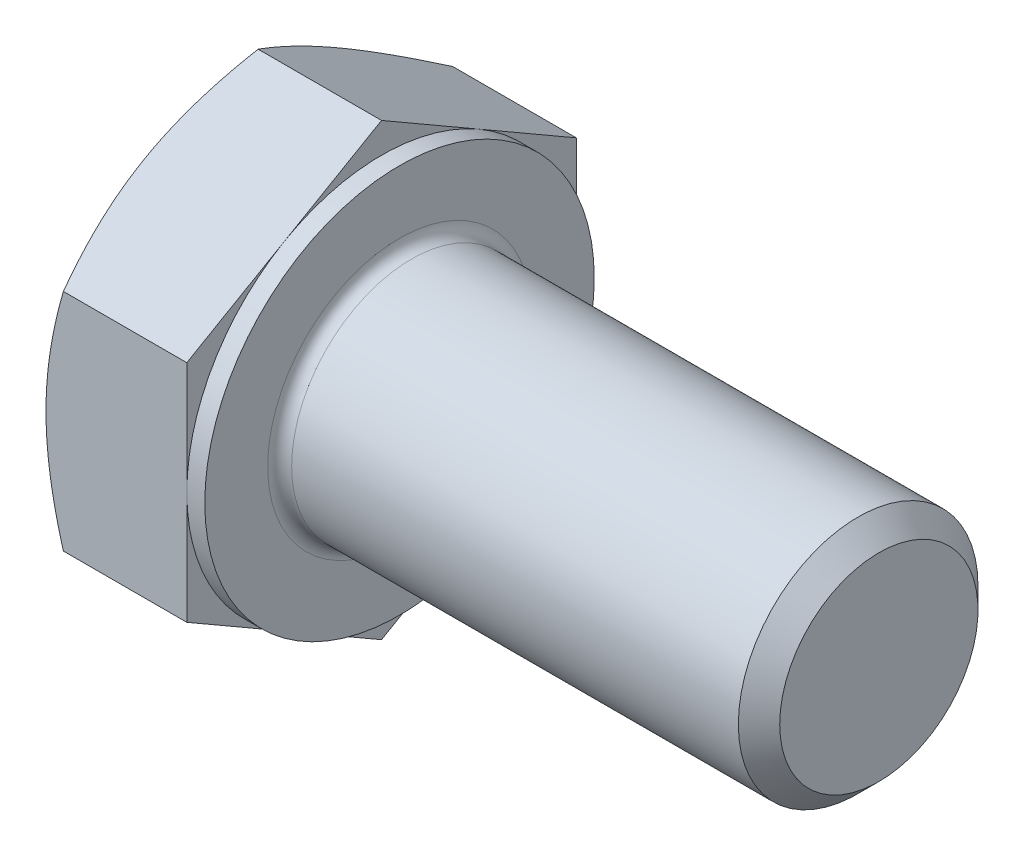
ISO-10303-21;
HEADER;
FILE_DESCRIPTION(('STEP AP214'),'2;1');
FILE_NAME('part.step','',(''),(''),'','','');
FILE_SCHEMA(('AUTOMOTIVE_DESIGN { 1 0 10303 214 1 1 1 1 }'));
ENDSEC;
DATA;
#1=APPLICATION_CONTEXT('core data for automotive mechanical design processes');
#2=APPLICATION_PROTOCOL_DEFINITION('international standard','automotive_design',2000,#1);
#3=PRODUCT_CONTEXT('',#1,'mechanical');
#4=PRODUCT('Part','Part','',(#3));
#5=PRODUCT_RELATED_PRODUCT_CATEGORY('part','',(#4));
#6=PRODUCT_DEFINITION_FORMATION('','',#4);
#7=PRODUCT_DEFINITION_CONTEXT('part definition',#1,'design');
#8=PRODUCT_DEFINITION('design','',#6,#7);
#9=PRODUCT_DEFINITION_SHAPE('','',#8);
#10=(LENGTH_UNIT() NAMED_UNIT(*) SI_UNIT(.MILLI.,.METRE.));
#11=(NAMED_UNIT(*) PLANE_ANGLE_UNIT() SI_UNIT($,.RADIAN.));
#12=(NAMED_UNIT(*) SI_UNIT($,.STERADIAN.) SOLID_ANGLE_UNIT());
#13=UNCERTAINTY_MEASURE_WITH_UNIT(LENGTH_MEASURE(1.E-05),#10,'distance_accuracy_value','');
#14=(GEOMETRIC_REPRESENTATION_CONTEXT(3) GLOBAL_UNCERTAINTY_ASSIGNED_CONTEXT((#13)) GLOBAL_UNIT_ASSIGNED_CONTEXT((#10,
#11,#12)) REPRESENTATION_CONTEXT('',''));
#15=CARTESIAN_POINT('',(0.,0.,0.));
#16=DIRECTION('',(0.,0.,1.));
#17=DIRECTION('',(1.,0.,0.));
#18=AXIS2_PLACEMENT_3D('',#15,#16,#17);
#19=CARTESIAN_POINT('',(5.3,0.,-13.));
#20=DIRECTION('',(1.,0.,0.));
#21=DIRECTION('',(0.,0.,-1.));
#22=AXIS2_PLACEMENT_3D('',#19,#20,#21);
#23=PLANE('',#22);
#24=CARTESIAN_POINT('',(5.3,0.,0.));
#25=DIRECTION('',(1.,0.,0.));
#26=DIRECTION('',(0.,0.,-1.));
#27=AXIS2_PLACEMENT_3D('',#24,#25,#26);
#28=CIRCLE('',#27,4.4);
#29=CARTESIAN_POINT('',(5.3,0.,-4.4));
#30=VERTEX_POINT('',#29);
#31=EDGE_CURVE('E49',#30,#30,#28,.F.);
#32=ORIENTED_EDGE('',*,*,#31,.T.);
#33=EDGE_LOOP('',(#32));
#34=FACE_BOUND('',#33,.T.);
#35=CARTESIAN_POINT('',(5.3,0.,0.));
#36=DIRECTION('',(1.,0.,0.));
#37=DIRECTION('',(0.,0.,-1.));
#38=AXIS2_PLACEMENT_3D('',#35,#36,#37);
#39=CIRCLE('',#38,6.5);
#40=CARTESIAN_POINT('',(5.3,0.,-6.5));
#41=VERTEX_POINT('',#40);
#42=EDGE_CURVE('E308',#41,#41,#39,.T.);
#43=ORIENTED_EDGE('',*,*,#42,.T.);
#44=EDGE_LOOP('',(#43));
#45=FACE_BOUND('',#44,.T.);
#46=ADVANCED_FACE('F41',(#34,#45),#23,.T.);
#47=CARTESIAN_POINT('',(0.,0.,0.));
#48=DIRECTION('',(-1.,0.,0.));
#49=DIRECTION('',(0.,0.,1.));
#50=AXIS2_PLACEMENT_3D('',#47,#48,#49);
#51=CYLINDRICAL_SURFACE('',#50,4.);
#52=CARTESIAN_POINT('',(5.7,0.,0.));
#53=DIRECTION('',(1.,0.,0.));
#54=DIRECTION('',(0.,0.,-1.));
#55=AXIS2_PLACEMENT_3D('',#52,#53,#54);
#56=CIRCLE('',#55,4.);
#57=CARTESIAN_POINT('',(5.7,0.,-4.));
#58=VERTEX_POINT('',#57);
#59=EDGE_CURVE('E11',#58,#58,#56,.T.);
#60=ORIENTED_EDGE('',*,*,#59,.T.);
#61=EDGE_LOOP('',(#60));
#62=FACE_BOUND('',#61,.T.);
#63=CARTESIAN_POINT('',(20.6095,0.,0.));
#64=DIRECTION('',(-1.,0.,0.));
#65=DIRECTION('',(0.,0.,1.));
#66=AXIS2_PLACEMENT_3D('',#63,#64,#65);
#67=CIRCLE('',#66,4.);
#68=CARTESIAN_POINT('',(20.6095,0.,4.));
#69=VERTEX_POINT('',#68);
#70=EDGE_CURVE('E287',#69,#69,#67,.T.);
#71=ORIENTED_EDGE('',*,*,#70,.T.);
#72=EDGE_LOOP('',(#71));
#73=FACE_BOUND('',#72,.T.);
#74=ADVANCED_FACE('F259',(#62,#73),#51,.T.);
#75=CARTESIAN_POINT('',(21.3,0.,0.));
#76=DIRECTION('',(-1.,0.,0.));
#77=DIRECTION('',(0.,0.,1.));
#78=AXIS2_PLACEMENT_3D('',#75,#76,#77);
#79=CONICAL_SURFACE('',#78,3.3095,0.785398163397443);
#80=ORIENTED_EDGE('',*,*,#70,.F.);
#81=EDGE_LOOP('',(#80));
#82=FACE_BOUND('',#81,.T.);
#83=CARTESIAN_POINT('',(21.3,0.,0.));
#84=DIRECTION('',(-1.,0.,0.));
#85=DIRECTION('',(0.,0.,1.));
#86=AXIS2_PLACEMENT_3D('',#83,#84,#85);
#87=CIRCLE('',#86,3.3095);
#88=CARTESIAN_POINT('',(21.3,0.,3.3095));
#89=VERTEX_POINT('',#88);
#90=EDGE_CURVE('E285',#89,#89,#87,.T.);
#91=ORIENTED_EDGE('',*,*,#90,.T.);
#92=EDGE_LOOP('',(#91));
#93=FACE_BOUND('',#92,.T.);
#94=ADVANCED_FACE('F265',(#82,#93),#79,.T.);
#95=CARTESIAN_POINT('',(21.3,0.,0.));
#96=DIRECTION('',(-1.,0.,0.));
#97=DIRECTION('',(0.,0.,1.));
#98=AXIS2_PLACEMENT_3D('',#95,#96,#97);
#99=PLANE('',#98);
#100=ORIENTED_EDGE('',*,*,#90,.F.);
#101=EDGE_LOOP('',(#100));
#102=FACE_BOUND('',#101,.T.);
#103=ADVANCED_FACE('F272',(#102),#99,.F.);
#104=CARTESIAN_POINT('',(4.7,6.5,0.));
#105=DIRECTION('',(1.,0.,0.));
#106=DIRECTION('',(0.,0.,-1.));
#107=AXIS2_PLACEMENT_3D('',#104,#105,#106);
#108=PLANE('',#107);
#109=DIRECTION('',(0.,0.500000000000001,0.866025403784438));
#110=VECTOR('',#109,1.);
#111=CARTESIAN_POINT('',(4.7,3.75277674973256,-6.5));
#112=LINE('',#111,#110);
#113=CARTESIAN_POINT('',(4.7,3.75277674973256,-6.5));
#114=VERTEX_POINT('',#113);
#115=CARTESIAN_POINT('',(4.7,5.62916512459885,-3.25000000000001));
#116=VERTEX_POINT('',#115);
#117=EDGE_CURVE('E173',#114,#116,#112,.T.);
#118=ORIENTED_EDGE('',*,*,#117,.T.);
#119=CARTESIAN_POINT('',(4.7,0.,0.));
#120=DIRECTION('',(-1.,0.,0.));
#121=DIRECTION('',(0.,0.,1.));
#122=AXIS2_PLACEMENT_3D('',#119,#120,#121);
#123=CIRCLE('',#122,6.5);
#124=CARTESIAN_POINT('',(4.7,0.,-6.5));
#125=VERTEX_POINT('',#124);
#126=EDGE_CURVE('E56',#116,#125,#123,.T.);
#127=ORIENTED_EDGE('',*,*,#126,.T.);
#128=DIRECTION('',(0.,1.,0.));
#129=VECTOR('',#128,1.);
#130=CARTESIAN_POINT('',(4.7,3.75277674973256,-6.5));
#131=LINE('',#130,#129);
#132=EDGE_CURVE('E311',#125,#114,#131,.T.);
#133=ORIENTED_EDGE('',*,*,#132,.T.);
#134=EDGE_LOOP('',(#118,#127,#133));
#135=FACE_BOUND('',#134,.T.);
#136=ADVANCED_FACE('F275',(#135),#108,.T.);
#137=CARTESIAN_POINT('',(4.7,7.50555349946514,0.));
#138=VERTEX_POINT('',#137);
#139=EDGE_CURVE('E171',#116,#138,#112,.T.);
#140=ORIENTED_EDGE('',*,*,#139,.T.);
#141=DIRECTION('',(0.,-0.500000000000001,0.866025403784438));
#142=VECTOR('',#141,1.);
#143=CARTESIAN_POINT('',(4.7,7.50555349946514,0.));
#144=LINE('',#143,#142);
#145=CARTESIAN_POINT('',(4.7,5.62916512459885,3.25000000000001));
#146=VERTEX_POINT('',#145);
#147=EDGE_CURVE('E170',#138,#146,#144,.T.);
#148=ORIENTED_EDGE('',*,*,#147,.T.);
#149=EDGE_CURVE('E159',#146,#116,#123,.T.);
#150=ORIENTED_EDGE('',*,*,#149,.T.);
#151=EDGE_LOOP('',(#140,#148,#150));
#152=FACE_BOUND('',#151,.T.);
#153=ADVANCED_FACE('F281',(#152),#108,.T.);
#154=CARTESIAN_POINT('',(4.7,3.75277674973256,6.5));
#155=VERTEX_POINT('',#154);
#156=EDGE_CURVE('E138',#146,#155,#144,.T.);
#157=ORIENTED_EDGE('',*,*,#156,.T.);
#158=DIRECTION('',(0.,-1.,0.));
#159=VECTOR('',#158,1.);
#160=CARTESIAN_POINT('',(4.7,3.75277674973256,6.5));
#161=LINE('',#160,#159);
#162=CARTESIAN_POINT('',(4.7,0.,6.5));
#163=VERTEX_POINT('',#162);
#164=EDGE_CURVE('E132',#155,#163,#161,.T.);
#165=ORIENTED_EDGE('',*,*,#164,.T.);
#166=EDGE_CURVE('E136',#163,#146,#123,.T.);
#167=ORIENTED_EDGE('',*,*,#166,.T.);
#168=EDGE_LOOP('',(#157,#165,#167));
#169=FACE_BOUND('',#168,.T.);
#170=ADVANCED_FACE('F134',(#169),#108,.T.);
#171=CARTESIAN_POINT('',(4.7,-3.75277674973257,6.5));
#172=VERTEX_POINT('',#171);
#173=EDGE_CURVE('E142',#163,#172,#161,.T.);
#174=ORIENTED_EDGE('',*,*,#173,.T.);
#175=DIRECTION('',(0.,-0.500000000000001,-0.866025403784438));
#176=VECTOR('',#175,1.);
#177=CARTESIAN_POINT('',(4.7,-7.50555349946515,0.));
#178=LINE('',#177,#176);
#179=CARTESIAN_POINT('',(4.7,-5.62916512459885,3.25000000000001));
#180=VERTEX_POINT('',#179);
#181=EDGE_CURVE('E149',#172,#180,#178,.T.);
#182=ORIENTED_EDGE('',*,*,#181,.T.);
#183=EDGE_CURVE('E146',#180,#163,#123,.T.);
#184=ORIENTED_EDGE('',*,*,#183,.T.);
#185=EDGE_LOOP('',(#174,#182,#184));
#186=FACE_BOUND('',#185,.T.);
#187=ADVANCED_FACE('F147',(#186),#108,.T.);
#188=CARTESIAN_POINT('',(4.7,-7.50555349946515,0.));
#189=VERTEX_POINT('',#188);
#190=EDGE_CURVE('E165',#180,#189,#178,.T.);
#191=ORIENTED_EDGE('',*,*,#190,.T.);
#192=DIRECTION('',(0.,0.500000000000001,-0.866025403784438));
#193=VECTOR('',#192,1.);
#194=CARTESIAN_POINT('',(4.7,-3.75277674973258,-6.5));
#195=LINE('',#194,#193);
#196=CARTESIAN_POINT('',(4.7,-5.62916512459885,-3.25000000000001));
#197=VERTEX_POINT('',#196);
#198=EDGE_CURVE('E349',#189,#197,#195,.T.);
#199=ORIENTED_EDGE('',*,*,#198,.T.);
#200=EDGE_CURVE('E153',#197,#180,#123,.T.);
#201=ORIENTED_EDGE('',*,*,#200,.T.);
#202=EDGE_LOOP('',(#191,#199,#201));
#203=FACE_BOUND('',#202,.T.);
#204=ADVANCED_FACE('F350',(#203),#108,.T.);
#205=CARTESIAN_POINT('',(4.7,-3.75277674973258,-6.5));
#206=VERTEX_POINT('',#205);
#207=EDGE_CURVE('E160',#197,#206,#195,.T.);
#208=ORIENTED_EDGE('',*,*,#207,.T.);
#209=EDGE_CURVE('E312',#206,#125,#131,.T.);
#210=ORIENTED_EDGE('',*,*,#209,.T.);
#211=EDGE_CURVE('E319',#125,#197,#123,.T.);
#212=ORIENTED_EDGE('',*,*,#211,.T.);
#213=EDGE_LOOP('',(#208,#210,#212));
#214=FACE_BOUND('',#213,.T.);
#215=ADVANCED_FACE('F282',(#214),#108,.T.);
#216=CARTESIAN_POINT('',(0.,0.,0.));
#217=DIRECTION('',(-1.,0.,0.));
#218=DIRECTION('',(0.,0.,1.));
#219=AXIS2_PLACEMENT_3D('',#216,#217,#218);
#220=CYLINDRICAL_SURFACE('',#219,6.5);
#221=ORIENTED_EDGE('',*,*,#126,.F.);
#222=ORIENTED_EDGE('',*,*,#149,.F.);
#223=ORIENTED_EDGE('',*,*,#166,.F.);
#224=ORIENTED_EDGE('',*,*,#183,.F.);
#225=ORIENTED_EDGE('',*,*,#200,.F.);
#226=ORIENTED_EDGE('',*,*,#211,.F.);
#227=EDGE_LOOP('',(#221,#222,#223,#224,#225,#226));
#228=FACE_BOUND('',#227,.T.);
#229=ORIENTED_EDGE('',*,*,#42,.F.);
#230=EDGE_LOOP('',(#229));
#231=FACE_BOUND('',#230,.T.);
#232=ADVANCED_FACE('F156',(#228,#231),#220,.T.);
#233=CARTESIAN_POINT('',(0.,0.,-13.));
#234=DIRECTION('',(1.,0.,0.));
#235=DIRECTION('',(0.,0.,-1.));
#236=AXIS2_PLACEMENT_3D('',#233,#234,#235);
#237=PLANE('',#236);
#238=CARTESIAN_POINT('',(0.,0.,0.));
#239=DIRECTION('',(1.,0.,0.));
#240=DIRECTION('',(0.,0.,-1.));
#241=AXIS2_PLACEMENT_3D('',#238,#239,#240);
#242=CIRCLE('',#241,6.5);
#243=CARTESIAN_POINT('',(0.,0.,-6.5));
#244=VERTEX_POINT('',#243);
#245=CARTESIAN_POINT('',(0.,5.62916512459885,-3.25000000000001));
#246=VERTEX_POINT('',#245);
#247=EDGE_CURVE('E307',#244,#246,#242,.T.);
#248=ORIENTED_EDGE('',*,*,#247,.F.);
#249=CARTESIAN_POINT('',(0.,-5.62916512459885,-3.25000000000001));
#250=VERTEX_POINT('',#249);
#251=EDGE_CURVE('E303',#250,#244,#242,.T.);
#252=ORIENTED_EDGE('',*,*,#251,.F.);
#253=CARTESIAN_POINT('',(0.,-5.62916512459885,3.25000000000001));
#254=VERTEX_POINT('',#253);
#255=EDGE_CURVE('E306',#254,#250,#242,.T.);
#256=ORIENTED_EDGE('',*,*,#255,.F.);
#257=CARTESIAN_POINT('',(0.,0.,6.5));
#258=VERTEX_POINT('',#257);
#259=EDGE_CURVE('E342',#258,#254,#242,.T.);
#260=ORIENTED_EDGE('',*,*,#259,.F.);
#261=CARTESIAN_POINT('',(0.,0.,0.));
#262=DIRECTION('',(-1.,0.,0.));
#263=DIRECTION('',(0.,0.,1.));
#264=AXIS2_PLACEMENT_3D('',#261,#262,#263);
#265=CIRCLE('',#264,6.5);
#266=CARTESIAN_POINT('',(0.,5.62916512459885,3.25000000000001));
#267=VERTEX_POINT('',#266);
#268=EDGE_CURVE('E174',#258,#267,#265,.T.);
#269=ORIENTED_EDGE('',*,*,#268,.T.);
#270=EDGE_CURVE('E365',#246,#267,#242,.T.);
#271=ORIENTED_EDGE('',*,*,#270,.F.);
#272=EDGE_LOOP('',(#248,#252,#256,#260,#269,#271));
#273=FACE_BOUND('',#272,.T.);
#274=ADVANCED_FACE('F205',(#273),#237,.F.);
#275=CARTESIAN_POINT('',(0.,0.,0.));
#276=DIRECTION('',(1.,0.,0.));
#277=DIRECTION('',(0.,0.,-1.));
#278=AXIS2_PLACEMENT_3D('',#275,#276,#277);
#279=CONICAL_SURFACE('',#278,6.5,1.0471975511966);
#280=CARTESIAN_POINT('',(0.580623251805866,3.75266127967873,6.5002));
#281=CARTESIAN_POINT('',(0.533004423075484,3.8351516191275,6.35732254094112));
#282=CARTESIAN_POINT('',(0.487546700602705,3.91794952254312,6.21391236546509));
#283=CARTESIAN_POINT('',(0.401548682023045,4.08421773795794,5.92592736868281));
#284=CARTESIAN_POINT('',(0.361010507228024,4.16768832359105,5.78135207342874));
#285=CARTESIAN_POINT('',(0.247571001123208,4.41943655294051,5.34531134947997));
#286=CARTESIAN_POINT('',(0.183047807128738,4.58870793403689,5.05212471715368));
#287=CARTESIAN_POINT('',(0.107386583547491,4.84201947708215,4.61337625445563));
#288=CARTESIAN_POINT('',(0.0858328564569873,4.92530276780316,4.46912536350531));
#289=CARTESIAN_POINT('',(0.049690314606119,5.09224566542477,4.17997178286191));
#290=CARTESIAN_POINT('',(0.0351008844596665,5.17590523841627,4.03506915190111));
#291=CARTESIAN_POINT('',(0.0132587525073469,5.34336968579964,3.74501222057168));
#292=CARTESIAN_POINT('',(0.00599772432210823,5.427174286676,3.59985839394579));
#293=CARTESIAN_POINT('',(-0.00103969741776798,5.59485627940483,3.30942466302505));
#294=CARTESIAN_POINT('',(-0.00081632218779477,5.6787336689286,3.16414476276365));
#295=CARTESIAN_POINT('',(0.0100834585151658,5.90853103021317,2.76612405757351));
#296=CARTESIAN_POINT('',(0.028381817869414,6.05437578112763,2.51351353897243));
#297=CARTESIAN_POINT('',(0.0864063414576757,6.34509659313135,2.00997032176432));
#298=CARTESIAN_POINT('',(0.126152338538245,6.48997163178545,1.75903939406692));
#299=CARTESIAN_POINT('',(0.22550590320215,6.78127752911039,1.25448277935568));
#300=CARTESIAN_POINT('',(0.285534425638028,6.92767163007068,1.00092075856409));
#301=CARTESIAN_POINT('',(0.42177499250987,7.21827667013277,0.497578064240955));
#302=CARTESIAN_POINT('',(0.497955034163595,7.36249133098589,0.247790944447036));
#303=CARTESIAN_POINT('',(0.580623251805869,7.50566896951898,-0.000200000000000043));
#304=B_SPLINE_CURVE_WITH_KNOTS('',3,(#280,#281,#282,#283,#284,#285,#286,#287,#288,#289,#290,
#291,#292,#293,#294,#295,#296,#297,#298,#299,#300,#301,#302,#303),.UNSPECIFIED.,.F.,.F.,(4,2,2,
2,2,2,2,2,2,2,2,4),(0.,0.515105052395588,1.03043143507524,2.06322554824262,2.56697389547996,
3.07067772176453,3.57380860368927,4.0769239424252,4.9527935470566,5.82947446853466,
6.72559912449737,7.61996451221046),.UNSPECIFIED.);
#305=CARTESIAN_POINT('',(0.580556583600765,7.50555349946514,0.));
#306=VERTEX_POINT('',#305);
#307=EDGE_CURVE('E225',#267,#306,#304,.T.);
#308=ORIENTED_EDGE('',*,*,#307,.T.);
#309=CARTESIAN_POINT('',(0.580623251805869,7.50566896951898,0.0002));
#310=CARTESIAN_POINT('',(0.533004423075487,7.4231786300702,-0.14267745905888));
#311=CARTESIAN_POINT('',(0.487546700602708,7.34038072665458,-0.286087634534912));
#312=CARTESIAN_POINT('',(0.401548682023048,7.17411251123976,-0.574072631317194));
#313=CARTESIAN_POINT('',(0.361010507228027,7.09064192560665,-0.718647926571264));
#314=CARTESIAN_POINT('',(0.24757100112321,6.83889369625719,-1.15468865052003));
#315=CARTESIAN_POINT('',(0.18304780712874,6.66962231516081,-1.44787528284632));
#316=CARTESIAN_POINT('',(0.107386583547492,6.41631077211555,-1.88662374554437));
#317=CARTESIAN_POINT('',(0.0858328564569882,6.33302748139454,-2.03087463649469));
#318=CARTESIAN_POINT('',(0.0496903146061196,6.16608458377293,-2.32002821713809));
#319=CARTESIAN_POINT('',(0.0351008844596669,6.08242501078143,-2.46493084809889));
#320=CARTESIAN_POINT('',(0.0132587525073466,5.91496056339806,-2.75498777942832));
#321=CARTESIAN_POINT('',(0.00599772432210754,5.8311559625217,-2.90014160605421));
#322=CARTESIAN_POINT('',(-0.00103969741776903,5.66347396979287,-3.19057533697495));
#323=CARTESIAN_POINT('',(-0.000816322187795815,5.5795965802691,-3.33585523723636));
#324=CARTESIAN_POINT('',(0.0100834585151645,5.34979921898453,-3.73387594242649));
#325=CARTESIAN_POINT('',(0.0283818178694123,5.20395446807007,-3.98648646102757));
#326=CARTESIAN_POINT('',(0.0864063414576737,4.91323365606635,-4.49002967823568));
#327=CARTESIAN_POINT('',(0.126152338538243,4.76835861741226,-4.74096060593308));
#328=CARTESIAN_POINT('',(0.225505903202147,4.47705272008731,-5.24551722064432));
#329=CARTESIAN_POINT('',(0.285534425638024,4.33065861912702,-5.49907924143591));
#330=CARTESIAN_POINT('',(0.421774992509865,4.04005357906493,-6.00242193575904));
#331=CARTESIAN_POINT('',(0.49795503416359,3.89583891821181,-6.25220905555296));
#332=CARTESIAN_POINT('',(0.580623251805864,3.75266127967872,-6.5002));
#333=B_SPLINE_CURVE_WITH_KNOTS('',3,(#309,#310,#311,#312,#313,#314,#315,#316,#317,#318,#319,
#320,#321,#322,#323,#324,#325,#326,#327,#328,#329,#330,#331,#332),.UNSPECIFIED.,.F.,.F.,(4,2,2,
2,2,2,2,2,2,2,2,4),(0.,0.515105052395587,1.03043143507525,2.06322554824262,2.56697389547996,
3.07067772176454,3.57380860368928,4.0769239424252,4.9527935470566,5.82947446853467,
6.72559912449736,7.61996451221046),.UNSPECIFIED.);
#334=EDGE_CURVE('E64',#306,#246,#333,.T.);
#335=ORIENTED_EDGE('',*,*,#334,.T.);
#336=ORIENTED_EDGE('',*,*,#270,.T.);
#337=EDGE_LOOP('',(#308,#335,#336));
#338=FACE_BOUND('',#337,.T.);
#339=ADVANCED_FACE('F366',(#338),#279,.T.);
#340=CARTESIAN_POINT('',(3.18835311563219,-10.1137456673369,6.5));
#341=CARTESIAN_POINT('',(3.05034773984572,-9.82952666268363,6.5));
#342=CARTESIAN_POINT('',(2.91365616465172,-9.54465869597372,6.5));
#343=CARTESIAN_POINT('',(2.64363899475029,-8.9732797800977,6.5));
#344=CARTESIAN_POINT('',(2.51031392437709,-8.68676858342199,6.5));
#345=CARTESIAN_POINT('',(2.24710473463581,-8.11029837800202,6.5));
#346=CARTESIAN_POINT('',(2.11724300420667,-7.82032911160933,6.5));
#347=CARTESIAN_POINT('',(1.86279082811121,-7.2380954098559,6.5));
#348=CARTESIAN_POINT('',(1.73820013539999,-6.94583108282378,6.5));
#349=CARTESIAN_POINT('',(1.49176685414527,-6.34906440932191,6.5));
#350=CARTESIAN_POINT('',(1.37014257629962,-6.04447142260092,6.5));
#351=CARTESIAN_POINT('',(1.13601865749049,-5.43173420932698,6.5));
#352=CARTESIAN_POINT('',(1.02352003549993,-5.12358959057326,6.5));
#353=CARTESIAN_POINT('',(0.810575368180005,-4.50382569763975,6.5));
#354=CARTESIAN_POINT('',(0.710105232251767,-4.19221478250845,6.5));
#355=CARTESIAN_POINT('',(0.524420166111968,-3.56452019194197,6.5));
#356=CARTESIAN_POINT('',(0.43920046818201,-3.24843794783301,6.5));
#357=CARTESIAN_POINT('',(0.28852422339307,-2.61335465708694,6.5));
#358=CARTESIAN_POINT('',(0.222961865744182,-2.29437912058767,6.5));
#359=CARTESIAN_POINT('',(0.115312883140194,-1.65238219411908,6.5));
#360=CARTESIAN_POINT('',(0.0732239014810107,-1.32936121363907,6.5));
#361=CARTESIAN_POINT('',(0.0304887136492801,-0.845231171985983,6.5));
#362=CARTESIAN_POINT('',(0.0196493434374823,-0.684982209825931,6.5));
#363=CARTESIAN_POINT('',(0.00475298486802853,-0.364162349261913,6.5));
#364=CARTESIAN_POINT('',(0.0006958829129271,-0.203591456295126,6.5));
#365=CARTESIAN_POINT('',(-0.000531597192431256,0.117577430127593,6.5));
#366=CARTESIAN_POINT('',(0.00229809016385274,0.278175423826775,6.5));
#367=CARTESIAN_POINT('',(0.0147726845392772,0.599108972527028,6.5));
#368=CARTESIAN_POINT('',(0.0244179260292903,0.759444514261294,6.5));
#369=CARTESIAN_POINT('',(0.0554961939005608,1.1436994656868,6.5));
#370=CARTESIAN_POINT('',(0.080103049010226,1.36736763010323,6.5));
#371=CARTESIAN_POINT('',(0.141246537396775,1.81305591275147,6.5));
#372=CARTESIAN_POINT('',(0.17778475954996,2.03507580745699,6.5));
#373=CARTESIAN_POINT('',(0.303360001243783,2.69839633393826,6.5));
#374=CARTESIAN_POINT('',(0.408335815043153,3.13672010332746,6.5));
#375=CARTESIAN_POINT('',(0.590564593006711,3.79232112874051,6.5));
#376=CARTESIAN_POINT('',(0.656313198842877,4.0129915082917,6.5));
#377=CARTESIAN_POINT('',(0.794681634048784,4.45218858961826,6.5));
#378=CARTESIAN_POINT('',(0.867301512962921,4.67071527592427,6.5));
#379=CARTESIAN_POINT('',(1.01824353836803,5.10569490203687,6.5));
#380=CARTESIAN_POINT('',(1.09656388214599,5.32214847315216,6.5));
#381=CARTESIAN_POINT('',(1.2579808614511,5.75325725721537,6.5));
#382=CARTESIAN_POINT('',(1.34107741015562,5.96791250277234,6.5));
#383=CARTESIAN_POINT('',(1.56029019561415,6.51888445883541,6.5));
#384=CARTESIAN_POINT('',(1.69936356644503,6.85402316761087,6.5));
#385=CARTESIAN_POINT('',(1.98501958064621,7.521095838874,6.5));
#386=CARTESIAN_POINT('',(2.13160288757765,7.85302951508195,6.5));
#387=CARTESIAN_POINT('',(2.43059748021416,8.51437865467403,6.5));
#388=CARTESIAN_POINT('',(2.5830105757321,8.84379329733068,6.5));
#389=CARTESIAN_POINT('',(2.89234869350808,9.50047798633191,6.5));
#390=CARTESIAN_POINT('',(3.04927357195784,9.82774810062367,6.5));
#391=CARTESIAN_POINT('',(3.36692013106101,10.4809971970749,6.5));
#392=CARTESIAN_POINT('',(3.52764676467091,10.8069737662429,6.5));
#393=CARTESIAN_POINT('',(3.85198555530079,11.4574882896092,6.5));
#394=CARTESIAN_POINT('',(4.01559773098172,11.7820262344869,6.5));
#395=CARTESIAN_POINT('',(4.50986184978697,12.753746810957,6.5));
#396=CARTESIAN_POINT('',(4.84399997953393,13.399155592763,6.5));
#397=CARTESIAN_POINT('',(5.48575990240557,14.6239779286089,6.5));
#398=CARTESIAN_POINT('',(5.79279643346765,15.20369957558,6.5));
#399=CARTESIAN_POINT('',(6.41069188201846,16.361138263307,6.5));
#400=CARTESIAN_POINT('',(6.72155098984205,16.9388552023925,6.5));
#401=CARTESIAN_POINT('',(7.34519775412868,18.0910273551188,6.5));
#402=CARTESIAN_POINT('',(7.65797694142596,18.6654871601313,6.5));
#403=CARTESIAN_POINT('',(8.28574397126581,19.8131486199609,6.5));
#404=CARTESIAN_POINT('',(8.60073166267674,20.386350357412,6.5));
#405=CARTESIAN_POINT('',(8.91652967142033,20.9591024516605,6.5));
#406=B_SPLINE_CURVE_WITH_KNOTS('',3,(#340,#341,#342,#343,#344,#345,#346,#347,#348,#349,#350,
#351,#352,#353,#354,#355,#356,#357,#358,#359,#360,#361,#362,#363,#364,#365,#366,#367,#368,#369,
#370,#371,#372,#373,#374,#375,#376,#377,#378,#379,#380,#381,#382,#383,#384,#385,#386,#387,#388,
#389,#390,#391,#392,#393,#394,#395,#396,#397,#398,#399,#400,#401,#402,#403,#404,#405),
.UNSPECIFIED.,.F.,.F.,(4,2,2,2,2,2,2,2,2,2,2,2,2,2,2,2,2,2,2,2,2,2,2,2,2,2,2,2,2,2,2,2,4),(0.,
0.947868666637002,1.89588406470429,2.84900320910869,3.80207763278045,4.78589774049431,
5.7698275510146,6.75175256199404,7.7333700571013,8.70960474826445,9.6857414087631,
10.1674651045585,10.6491807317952,11.1309009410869,11.612644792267,12.2873175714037,
12.9620802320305,14.3123184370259,15.0030310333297,15.6937486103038,16.3842486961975,
17.074736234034,18.1631508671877,19.2516618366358,20.3405135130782,21.4293305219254,
22.5196540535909,23.6099846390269,25.7902468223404,27.7582608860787,29.7263733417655,
31.6886408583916,33.6507753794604),.UNSPECIFIED.);
#407=CARTESIAN_POINT('',(0.580556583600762,3.75277674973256,6.5));
#408=VERTEX_POINT('',#407);
#409=EDGE_CURVE('E239',#258,#408,#406,.T.);
#410=ORIENTED_EDGE('',*,*,#409,.T.);
#411=EDGE_CURVE('E238',#408,#267,#304,.T.);
#412=ORIENTED_EDGE('',*,*,#411,.T.);
#413=ORIENTED_EDGE('',*,*,#268,.F.);
#414=EDGE_LOOP('',(#410,#412,#413));
#415=FACE_BOUND('',#414,.T.);
#416=ADVANCED_FACE('F336',(#415),#279,.T.);
#417=CARTESIAN_POINT('',(0.580556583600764,-3.75277674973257,6.5));
#418=VERTEX_POINT('',#417);
#419=EDGE_CURVE('E288',#418,#258,#406,.T.);
#420=ORIENTED_EDGE('',*,*,#419,.T.);
#421=ORIENTED_EDGE('',*,*,#259,.T.);
#422=CARTESIAN_POINT('',(0.580623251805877,-7.50566896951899,-0.000199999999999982));
#423=CARTESIAN_POINT('',(0.533004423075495,-7.42317863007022,0.14267745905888));
#424=CARTESIAN_POINT('',(0.487546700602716,-7.3403807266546,0.286087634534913));
#425=CARTESIAN_POINT('',(0.401548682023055,-7.17411251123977,0.574072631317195));
#426=CARTESIAN_POINT('',(0.361010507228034,-7.09064192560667,0.718647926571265));
#427=CARTESIAN_POINT('',(0.247571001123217,-6.8388936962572,1.15468865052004));
#428=CARTESIAN_POINT('',(0.183047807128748,-6.66962231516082,1.44787528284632));
#429=CARTESIAN_POINT('',(0.107386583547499,-6.41631077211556,1.88662374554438));
#430=CARTESIAN_POINT('',(0.0858328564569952,-6.33302748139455,2.03087463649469));
#431=CARTESIAN_POINT('',(0.0496903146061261,-6.16608458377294,2.32002821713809));
#432=CARTESIAN_POINT('',(0.0351008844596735,-6.08242501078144,2.46493084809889));
#433=CARTESIAN_POINT('',(0.0132587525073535,-5.91496056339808,2.75498777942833));
#434=CARTESIAN_POINT('',(0.00599772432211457,-5.83115596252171,2.90014160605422));
#435=CARTESIAN_POINT('',(-0.00103969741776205,-5.66347396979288,3.19057533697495));
#436=CARTESIAN_POINT('',(-0.000816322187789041,-5.57959658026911,3.33585523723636));
#437=CARTESIAN_POINT('',(0.0100834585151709,-5.34979921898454,3.7338759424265));
#438=CARTESIAN_POINT('',(0.0283818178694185,-5.20395446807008,3.98648646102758));
#439=CARTESIAN_POINT('',(0.0864063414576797,-4.91323365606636,4.49002967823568));
#440=CARTESIAN_POINT('',(0.126152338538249,-4.76835861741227,4.74096060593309));
#441=CARTESIAN_POINT('',(0.225505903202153,-4.47705272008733,5.24551722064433));
#442=CARTESIAN_POINT('',(0.28553442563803,-4.33065861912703,5.49907924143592));
#443=CARTESIAN_POINT('',(0.421774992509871,-4.04005357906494,6.00242193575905));
#444=CARTESIAN_POINT('',(0.497955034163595,-3.89583891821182,6.25220905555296));
#445=CARTESIAN_POINT('',(0.580623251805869,-3.75266127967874,6.5002));
#446=B_SPLINE_CURVE_WITH_KNOTS('',3,(#422,#423,#424,#425,#426,#427,#428,#429,#430,#431,#432,
#433,#434,#435,#436,#437,#438,#439,#440,#441,#442,#443,#444,#445),.UNSPECIFIED.,.F.,.F.,(4,2,2,
2,2,2,2,2,2,2,2,4),(0.,0.515105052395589,1.03043143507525,2.06322554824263,2.56697389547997,
3.07067772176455,3.57380860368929,4.07692394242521,4.95279354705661,5.82947446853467,
6.72559912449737,7.61996451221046),.UNSPECIFIED.);
#447=EDGE_CURVE('E227',#254,#418,#446,.T.);
#448=ORIENTED_EDGE('',*,*,#447,.T.);
#449=EDGE_LOOP('',(#420,#421,#448));
#450=FACE_BOUND('',#449,.T.);
#451=ADVANCED_FACE('F194',(#450),#279,.T.);
#452=CARTESIAN_POINT('',(0.580556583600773,-7.50555349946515,0.));
#453=VERTEX_POINT('',#452);
#454=EDGE_CURVE('E219',#453,#254,#446,.T.);
#455=ORIENTED_EDGE('',*,*,#454,.T.);
#456=ORIENTED_EDGE('',*,*,#255,.T.);
#457=CARTESIAN_POINT('',(0.58062325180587,-3.75266127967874,-6.5002));
#458=CARTESIAN_POINT('',(0.533004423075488,-3.83515161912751,-6.35732254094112));
#459=CARTESIAN_POINT('',(0.487546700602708,-3.91794952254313,-6.21391236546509));
#460=CARTESIAN_POINT('',(0.401548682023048,-4.08421773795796,-5.9259273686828));
#461=CARTESIAN_POINT('',(0.361010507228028,-4.16768832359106,-5.78135207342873));
#462=CARTESIAN_POINT('',(0.247571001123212,-4.41943655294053,-5.34531134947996));
#463=CARTESIAN_POINT('',(0.183047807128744,-4.58870793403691,-5.05212471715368));
#464=CARTESIAN_POINT('',(0.107386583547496,-4.84201947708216,-4.61337625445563));
#465=CARTESIAN_POINT('',(0.0858328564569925,-4.92530276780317,-4.46912536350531));
#466=CARTESIAN_POINT('',(0.0496903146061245,-5.09224566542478,-4.17997178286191));
#467=CARTESIAN_POINT('',(0.0351008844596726,-5.17590523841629,-4.03506915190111));
#468=CARTESIAN_POINT('',(0.0132587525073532,-5.34336968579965,-3.74501222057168));
#469=CARTESIAN_POINT('',(0.00599772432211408,-5.42717428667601,-3.59985839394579));
#470=CARTESIAN_POINT('',(-0.00103969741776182,-5.59485627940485,-3.30942466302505));
#471=CARTESIAN_POINT('',(-0.000816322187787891,-5.67873366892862,-3.16414476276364));
#472=CARTESIAN_POINT('',(0.0100834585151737,-5.90853103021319,-2.7661240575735));
#473=CARTESIAN_POINT('',(0.0283818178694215,-6.05437578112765,-2.51351353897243));
#474=CARTESIAN_POINT('',(0.0864063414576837,-6.34509659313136,-2.00997032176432));
#475=CARTESIAN_POINT('',(0.126152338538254,-6.48997163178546,-1.75903939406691));
#476=CARTESIAN_POINT('',(0.225505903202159,-6.7812775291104,-1.25448277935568));
#477=CARTESIAN_POINT('',(0.285534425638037,-6.92767163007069,-1.00092075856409));
#478=CARTESIAN_POINT('',(0.421774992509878,-7.21827667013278,-0.497578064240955));
#479=CARTESIAN_POINT('',(0.497955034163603,-7.3624913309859,-0.247790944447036));
#480=CARTESIAN_POINT('',(0.580623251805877,-7.50566896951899,0.000200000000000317));
#481=B_SPLINE_CURVE_WITH_KNOTS('',3,(#457,#458,#459,#460,#461,#462,#463,#464,#465,#466,#467,
#468,#469,#470,#471,#472,#473,#474,#475,#476,#477,#478,#479,#480),.UNSPECIFIED.,.F.,.F.,(4,2,2,
2,2,2,2,2,2,2,2,4),(0.,0.515105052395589,1.03043143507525,2.06322554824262,2.56697389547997,
3.07067772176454,3.57380860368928,4.0769239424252,4.95279354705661,5.82947446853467,
6.72559912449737,7.61996451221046),.UNSPECIFIED.);
#482=EDGE_CURVE('E226',#250,#453,#481,.T.);
#483=ORIENTED_EDGE('',*,*,#482,.T.);
#484=EDGE_LOOP('',(#455,#456,#483));
#485=FACE_BOUND('',#484,.T.);
#486=ADVANCED_FACE('F364',(#485),#279,.T.);
#487=CARTESIAN_POINT('',(0.58055658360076,3.75277674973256,-6.5));
#488=VERTEX_POINT('',#487);
#489=EDGE_CURVE('E228',#246,#488,#333,.T.);
#490=ORIENTED_EDGE('',*,*,#489,.T.);
#491=CARTESIAN_POINT('',(3.18835311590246,-10.1137456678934,-6.5));
#492=CARTESIAN_POINT('',(3.05034774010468,-9.82952666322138,-6.5));
#493=CARTESIAN_POINT('',(2.91365616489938,-9.54465869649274,-6.5));
#494=CARTESIAN_POINT('',(2.64363899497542,-8.97327978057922,-6.5));
#495=CARTESIAN_POINT('',(2.51031392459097,-8.68676858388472,-6.5));
#496=CARTESIAN_POINT('',(2.24710473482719,-8.11029837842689,-6.5));
#497=CARTESIAN_POINT('',(2.1172430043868,-7.82032911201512,-6.5));
#498=CARTESIAN_POINT('',(1.86279082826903,-7.2380954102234,-6.5));
#499=CARTESIAN_POINT('',(1.73820013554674,-6.94583108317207,-6.5));
#500=CARTESIAN_POINT('',(1.49176685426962,-6.34906440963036,-6.5));
#501=CARTESIAN_POINT('',(1.37014257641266,-6.04447142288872,-6.5));
#502=CARTESIAN_POINT('',(1.1360186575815,-5.43173420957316,-6.5));
#503=CARTESIAN_POINT('',(1.02352003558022,-5.12358959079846,-6.5));
#504=CARTESIAN_POINT('',(0.810575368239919,-4.5038256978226,-6.5));
#505=CARTESIAN_POINT('',(0.710105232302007,-4.19221478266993,-6.5));
#506=CARTESIAN_POINT('',(0.524420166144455,-3.56452019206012,-6.5));
#507=CARTESIAN_POINT('',(0.439200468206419,-3.24843794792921,-6.5));
#508=CARTESIAN_POINT('',(0.288524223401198,-2.61335465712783,-6.5));
#509=CARTESIAN_POINT('',(0.222961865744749,-2.29437912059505,-6.5));
#510=CARTESIAN_POINT('',(0.115312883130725,-1.65238219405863,-6.5));
#511=CARTESIAN_POINT('',(0.0732239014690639,-1.3293612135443,-6.5));
#512=CARTESIAN_POINT('',(0.0304887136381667,-0.845231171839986,-6.5));
#513=CARTESIAN_POINT('',(0.0196493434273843,-0.684982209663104,-6.5));
#514=CARTESIAN_POINT('',(0.00475298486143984,-0.364162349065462,-6.5));
#515=CARTESIAN_POINT('',(0.000695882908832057,-0.203591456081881,-6.5));
#516=CARTESIAN_POINT('',(-0.000531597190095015,0.117577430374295,-6.5));
#517=CARTESIAN_POINT('',(0.00229809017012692,0.278175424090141,-6.5));
#518=CARTESIAN_POINT('',(0.0147726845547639,0.599108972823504,-6.5));
#519=CARTESIAN_POINT('',(0.0244179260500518,0.759444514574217,-6.5));
#520=CARTESIAN_POINT('',(0.0554961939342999,1.14369946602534,-6.5));
#521=CARTESIAN_POINT('',(0.0801030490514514,1.36736763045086,-6.5));
#522=CARTESIAN_POINT('',(0.141246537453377,1.81305591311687,-6.5));
#523=CARTESIAN_POINT('',(0.177784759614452,2.03507580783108,-6.5));
#524=CARTESIAN_POINT('',(0.303360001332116,2.69839633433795,-6.5));
#525=CARTESIAN_POINT('',(0.408335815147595,3.13672010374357,-6.5));
#526=CARTESIAN_POINT('',(0.59056459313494,3.79232112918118,-6.5));
#527=CARTESIAN_POINT('',(0.656313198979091,4.01299150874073,-6.5));
#528=CARTESIAN_POINT('',(0.794681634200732,4.45218859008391,-6.5));
#529=CARTESIAN_POINT('',(0.867301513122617,4.67071527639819,-6.5));
#530=CARTESIAN_POINT('',(1.01824353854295,5.10569490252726,-6.5));
#531=CARTESIAN_POINT('',(1.09656388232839,5.32214847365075,-6.5));
#532=CARTESIAN_POINT('',(1.25798086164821,5.75325725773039,-6.5));
#533=CARTESIAN_POINT('',(1.34107741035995,5.96791250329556,-6.5));
#534=CARTESIAN_POINT('',(1.56029019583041,6.51888445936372,-6.5));
#535=CARTESIAN_POINT('',(1.69936356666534,6.85402316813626,-6.5));
#536=CARTESIAN_POINT('',(1.98501958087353,7.52109583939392,-6.5));
#537=CARTESIAN_POINT('',(2.13160288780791,7.85302951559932,-6.5));
#538=CARTESIAN_POINT('',(2.43059748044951,8.51437865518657,-6.5));
#539=CARTESIAN_POINT('',(2.58301057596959,8.84379329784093,-6.5));
#540=CARTESIAN_POINT('',(2.89234869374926,9.50047798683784,-6.5));
#541=CARTESIAN_POINT('',(3.04927357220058,9.82774810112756,-6.5));
#542=CARTESIAN_POINT('',(3.36692013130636,10.4809971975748,-6.5));
#543=CARTESIAN_POINT('',(3.52764676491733,10.8069737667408,-6.5));
#544=CARTESIAN_POINT('',(3.85198555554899,11.4574882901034,-6.5));
#545=CARTESIAN_POINT('',(4.01559773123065,11.7820262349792,-6.5));
#546=CARTESIAN_POINT('',(4.50986185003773,12.753746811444,-6.5));
#547=CARTESIAN_POINT('',(4.84399997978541,13.3991555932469,-6.5));
#548=CARTESIAN_POINT('',(5.48575990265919,14.6239779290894,-6.5));
#549=CARTESIAN_POINT('',(5.79279643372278,15.2036995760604,-6.5));
#550=CARTESIAN_POINT('',(6.4106918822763,16.3611382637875,-6.5));
#551=CARTESIAN_POINT('',(6.72155099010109,16.938855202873,-6.5));
#552=CARTESIAN_POINT('',(7.34519775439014,18.0910273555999,-6.5));
#553=CARTESIAN_POINT('',(7.65797694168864,18.665487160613,-6.5));
#554=CARTESIAN_POINT('',(8.28574397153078,19.8131486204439,-6.5));
#555=CARTESIAN_POINT('',(8.60073166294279,20.3863503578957,-6.5));
#556=CARTESIAN_POINT('',(8.91652967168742,20.9591024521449,-6.5));
#557=B_SPLINE_CURVE_WITH_KNOTS('',3,(#491,#492,#493,#494,#495,#496,#497,#498,#499,#500,#501,
#502,#503,#504,#505,#506,#507,#508,#509,#510,#511,#512,#513,#514,#515,#516,#517,#518,#519,#520,
#521,#522,#523,#524,#525,#526,#527,#528,#529,#530,#531,#532,#533,#534,#535,#536,#537,#538,#539,
#540,#541,#542,#543,#544,#545,#546,#547,#548,#549,#550,#551,#552,#553,#554,#555,#556),
.UNSPECIFIED.,.F.,.F.,(4,2,2,2,2,2,2,2,2,2,2,2,2,2,2,2,2,2,2,2,2,2,2,2,2,2,2,2,2,2,2,2,4),(0.,
0.947868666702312,1.89588406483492,2.84900320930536,3.80207763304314,4.7858977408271,
5.76982755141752,6.75175256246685,7.73337005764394,8.70960474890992,9.68574140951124,
10.1674651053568,10.6491807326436,11.1309009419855,11.6126447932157,12.287317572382,
12.9620802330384,14.312318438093,15.0030310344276,15.6937486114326,16.3842486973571,
17.0747362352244,18.1631508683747,19.2516618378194,20.3405135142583,21.4293305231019,
22.5196540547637,23.6099846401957,25.7902468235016,27.7582608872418,29.7263733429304,
31.6886408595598,33.6507753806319),.UNSPECIFIED.);
#558=EDGE_CURVE('E186',#488,#244,#557,.F.);
#559=ORIENTED_EDGE('',*,*,#558,.T.);
#560=ORIENTED_EDGE('',*,*,#247,.T.);
#561=EDGE_LOOP('',(#490,#559,#560));
#562=FACE_BOUND('',#561,.T.);
#563=ADVANCED_FACE('F361',(#562),#279,.T.);
#564=CARTESIAN_POINT('',(0.580556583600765,-3.75277674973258,-6.5));
#565=VERTEX_POINT('',#564);
#566=EDGE_CURVE('E187',#565,#250,#481,.T.);
#567=ORIENTED_EDGE('',*,*,#566,.T.);
#568=ORIENTED_EDGE('',*,*,#251,.T.);
#569=EDGE_CURVE('E177',#244,#565,#557,.F.);
#570=ORIENTED_EDGE('',*,*,#569,.T.);
#571=EDGE_LOOP('',(#567,#568,#570));
#572=FACE_BOUND('',#571,.T.);
#573=ADVANCED_FACE('F203',(#572),#279,.T.);
#574=CARTESIAN_POINT('',(5.3,3.75277674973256,-6.5));
#575=DIRECTION('',(0.,0.,1.));
#576=DIRECTION('',(0.,-1.,0.));
#577=AXIS2_PLACEMENT_3D('',#574,#575,#576);
#578=PLANE('',#577);
#579=ORIENTED_EDGE('',*,*,#209,.F.);
#580=DIRECTION('',(-1.,0.,0.));
#581=VECTOR('',#580,1.);
#582=CARTESIAN_POINT('',(5.3,-3.75277674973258,-6.5));
#583=LINE('',#582,#581);
#584=EDGE_CURVE('E294',#206,#565,#583,.T.);
#585=ORIENTED_EDGE('',*,*,#584,.T.);
#586=ORIENTED_EDGE('',*,*,#569,.F.);
#587=ORIENTED_EDGE('',*,*,#558,.F.);
#588=DIRECTION('',(-1.,0.,0.));
#589=VECTOR('',#588,1.);
#590=CARTESIAN_POINT('',(5.3,3.75277674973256,-6.5));
#591=LINE('',#590,#589);
#592=EDGE_CURVE('E290',#114,#488,#591,.T.);
#593=ORIENTED_EDGE('',*,*,#592,.F.);
#594=ORIENTED_EDGE('',*,*,#132,.F.);
#595=EDGE_LOOP('',(#579,#585,#586,#587,#593,#594));
#596=FACE_BOUND('',#595,.T.);
#597=ADVANCED_FACE('F198',(#596),#578,.F.);
#598=CARTESIAN_POINT('',(5.3,-3.75277674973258,-6.5));
#599=DIRECTION('',(0.,0.866025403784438,0.500000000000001));
#600=DIRECTION('',(0.,-0.500000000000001,0.866025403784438));
#601=AXIS2_PLACEMENT_3D('',#598,#599,#600);
#602=PLANE('',#601);
#603=ORIENTED_EDGE('',*,*,#198,.F.);
#604=DIRECTION('',(-1.,0.,0.));
#605=VECTOR('',#604,1.);
#606=CARTESIAN_POINT('',(5.3,-7.50555349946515,0.));
#607=LINE('',#606,#605);
#608=EDGE_CURVE('E296',#189,#453,#607,.T.);
#609=ORIENTED_EDGE('',*,*,#608,.T.);
#610=ORIENTED_EDGE('',*,*,#482,.F.);
#611=ORIENTED_EDGE('',*,*,#566,.F.);
#612=ORIENTED_EDGE('',*,*,#584,.F.);
#613=ORIENTED_EDGE('',*,*,#207,.F.);
#614=EDGE_LOOP('',(#603,#609,#610,#611,#612,#613));
#615=FACE_BOUND('',#614,.T.);
#616=ADVANCED_FACE('F202',(#615),#602,.F.);
#617=CARTESIAN_POINT('',(5.3,-7.50555349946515,0.));
#618=DIRECTION('',(0.,0.866025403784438,-0.500000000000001));
#619=DIRECTION('',(0.,0.500000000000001,0.866025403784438));
#620=AXIS2_PLACEMENT_3D('',#617,#618,#619);
#621=PLANE('',#620);
#622=ORIENTED_EDGE('',*,*,#181,.F.);
#623=DIRECTION('',(-1.,0.,0.));
#624=VECTOR('',#623,1.);
#625=CARTESIAN_POINT('',(5.3,-3.75277674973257,6.5));
#626=LINE('',#625,#624);
#627=EDGE_CURVE('E164',#172,#418,#626,.T.);
#628=ORIENTED_EDGE('',*,*,#627,.T.);
#629=ORIENTED_EDGE('',*,*,#447,.F.);
#630=ORIENTED_EDGE('',*,*,#454,.F.);
#631=ORIENTED_EDGE('',*,*,#608,.F.);
#632=ORIENTED_EDGE('',*,*,#190,.F.);
#633=EDGE_LOOP('',(#622,#628,#629,#630,#631,#632));
#634=FACE_BOUND('',#633,.T.);
#635=ADVANCED_FACE('F210',(#634),#621,.F.);
#636=CARTESIAN_POINT('',(5.3,3.75277674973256,6.5));
#637=DIRECTION('',(0.,0.,-1.));
#638=DIRECTION('',(0.,1.,0.));
#639=AXIS2_PLACEMENT_3D('',#636,#637,#638);
#640=PLANE('',#639);
#641=ORIENTED_EDGE('',*,*,#164,.F.);
#642=DIRECTION('',(-1.,0.,0.));
#643=VECTOR('',#642,1.);
#644=CARTESIAN_POINT('',(5.3,3.75277674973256,6.5));
#645=LINE('',#644,#643);
#646=EDGE_CURVE('E299',#155,#408,#645,.T.);
#647=ORIENTED_EDGE('',*,*,#646,.T.);
#648=ORIENTED_EDGE('',*,*,#409,.F.);
#649=ORIENTED_EDGE('',*,*,#419,.F.);
#650=ORIENTED_EDGE('',*,*,#627,.F.);
#651=ORIENTED_EDGE('',*,*,#173,.F.);
#652=EDGE_LOOP('',(#641,#647,#648,#649,#650,#651));
#653=FACE_BOUND('',#652,.T.);
#654=ADVANCED_FACE('F162',(#653),#640,.F.);
#655=CARTESIAN_POINT('',(5.3,7.50555349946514,0.));
#656=DIRECTION('',(0.,-0.866025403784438,-0.500000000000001));
#657=DIRECTION('',(0.,0.500000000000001,-0.866025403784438));
#658=AXIS2_PLACEMENT_3D('',#655,#656,#657);
#659=PLANE('',#658);
#660=ORIENTED_EDGE('',*,*,#147,.F.);
#661=DIRECTION('',(-1.,0.,0.));
#662=VECTOR('',#661,1.);
#663=CARTESIAN_POINT('',(5.3,7.50555349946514,0.));
#664=LINE('',#663,#662);
#665=EDGE_CURVE('E301',#138,#306,#664,.T.);
#666=ORIENTED_EDGE('',*,*,#665,.T.);
#667=ORIENTED_EDGE('',*,*,#307,.F.);
#668=ORIENTED_EDGE('',*,*,#411,.F.);
#669=ORIENTED_EDGE('',*,*,#646,.F.);
#670=ORIENTED_EDGE('',*,*,#156,.F.);
#671=EDGE_LOOP('',(#660,#666,#667,#668,#669,#670));
#672=FACE_BOUND('',#671,.T.);
#673=ADVANCED_FACE('F245',(#672),#659,.F.);
#674=CARTESIAN_POINT('',(5.3,3.75277674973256,-6.5));
#675=DIRECTION('',(0.,-0.866025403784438,0.500000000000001));
#676=DIRECTION('',(0.,-0.500000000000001,-0.866025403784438));
#677=AXIS2_PLACEMENT_3D('',#674,#675,#676);
#678=PLANE('',#677);
#679=ORIENTED_EDGE('',*,*,#117,.F.);
#680=ORIENTED_EDGE('',*,*,#592,.T.);
#681=ORIENTED_EDGE('',*,*,#489,.F.);
#682=ORIENTED_EDGE('',*,*,#334,.F.);
#683=ORIENTED_EDGE('',*,*,#665,.F.);
#684=ORIENTED_EDGE('',*,*,#139,.F.);
#685=EDGE_LOOP('',(#679,#680,#681,#682,#683,#684));
#686=FACE_BOUND('',#685,.T.);
#687=ADVANCED_FACE('F248',(#686),#678,.F.);
#688=CARTESIAN_POINT('',(5.7,0.,0.));
#689=DIRECTION('',(1.,0.,0.));
#690=DIRECTION('',(0.,0.,-1.));
#691=AXIS2_PLACEMENT_3D('',#688,#689,#690);
#692=TOROIDAL_SURFACE('',#691,4.4,0.4);
#693=ORIENTED_EDGE('',*,*,#59,.F.);
#694=EDGE_LOOP('',(#693));
#695=FACE_BOUND('',#694,.T.);
#696=ORIENTED_EDGE('',*,*,#31,.F.);
#697=EDGE_LOOP('',(#696));
#698=FACE_BOUND('',#697,.T.);
#699=ADVANCED_FACE('F43',(#695,#698),#692,.F.);
#700=CLOSED_SHELL('',(#46,#74,#94,#103,#136,#153,#170,#187,#204,#215,#232,#274,#339,#416,#451,
#486,#563,#573,#597,#616,#635,#654,#673,#687,#699));
#701=MANIFOLD_SOLID_BREP('B2',#700);
#702=ADVANCED_BREP_SHAPE_REPRESENTATION('',(#18,#701),#14);
#703=SHAPE_DEFINITION_REPRESENTATION(#9,#702);
ENDSEC;
END-ISO-10303-21;
